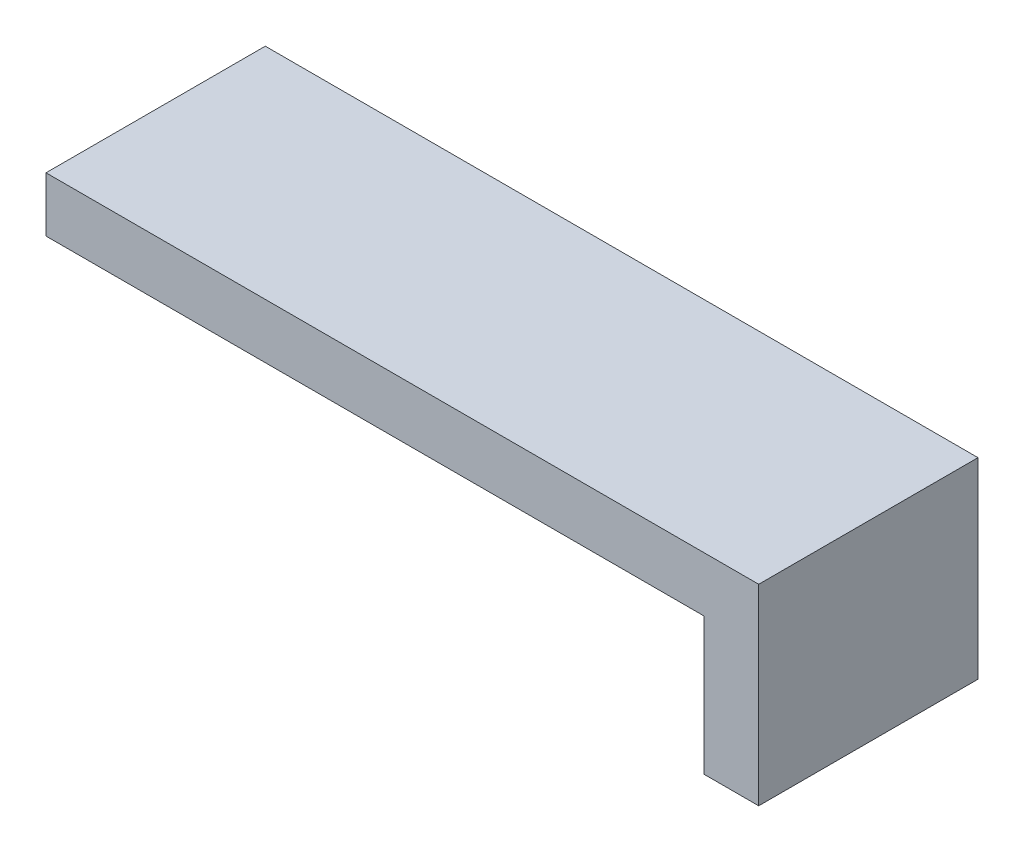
ISO-10303-21;
HEADER;
FILE_DESCRIPTION(('STEP AP214'),'2;1');
FILE_NAME('part.step','',(''),(''),'','','');
FILE_SCHEMA(('AUTOMOTIVE_DESIGN { 1 0 10303 214 1 1 1 1 }'));
ENDSEC;
DATA;
#1=APPLICATION_CONTEXT('core data for automotive mechanical design processes');
#2=APPLICATION_PROTOCOL_DEFINITION('international standard','automotive_design',2000,#1);
#3=PRODUCT_CONTEXT('',#1,'mechanical');
#4=PRODUCT('Part','Part','',(#3));
#5=PRODUCT_RELATED_PRODUCT_CATEGORY('part','',(#4));
#6=PRODUCT_DEFINITION_FORMATION('','',#4);
#7=PRODUCT_DEFINITION_CONTEXT('part definition',#1,'design');
#8=PRODUCT_DEFINITION('design','',#6,#7);
#9=PRODUCT_DEFINITION_SHAPE('','',#8);
#10=(LENGTH_UNIT() NAMED_UNIT(*) SI_UNIT(.MILLI.,.METRE.));
#11=(NAMED_UNIT(*) PLANE_ANGLE_UNIT() SI_UNIT($,.RADIAN.));
#12=(NAMED_UNIT(*) SI_UNIT($,.STERADIAN.) SOLID_ANGLE_UNIT());
#13=UNCERTAINTY_MEASURE_WITH_UNIT(LENGTH_MEASURE(1.E-05),#10,'distance_accuracy_value','');
#14=(GEOMETRIC_REPRESENTATION_CONTEXT(3) GLOBAL_UNCERTAINTY_ASSIGNED_CONTEXT((#13)) GLOBAL_UNIT_ASSIGNED_CONTEXT((#10,
#11,#12)) REPRESENTATION_CONTEXT('',''));
#15=CARTESIAN_POINT('',(0.,0.,0.));
#16=DIRECTION('',(0.,0.,1.));
#17=DIRECTION('',(1.,0.,0.));
#18=AXIS2_PLACEMENT_3D('',#15,#16,#17);
#19=CARTESIAN_POINT('',(-60.,4.99999999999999,20.));
#20=DIRECTION('',(1.,0.,0.));
#21=DIRECTION('',(0.,1.,0.));
#22=AXIS2_PLACEMENT_3D('',#19,#20,#21);
#23=PLANE('',#22);
#24=DIRECTION('',(0.,-1.,0.));
#25=VECTOR('',#24,1.);
#26=CARTESIAN_POINT('',(-60.,4.99999999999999,-20.));
#27=LINE('',#26,#25);
#28=CARTESIAN_POINT('',(-60.,4.99999999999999,-20.));
#29=VERTEX_POINT('',#28);
#30=CARTESIAN_POINT('',(-59.9999999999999,-5.,-20.));
#31=VERTEX_POINT('',#30);
#32=EDGE_CURVE('E119',#29,#31,#27,.T.);
#33=ORIENTED_EDGE('',*,*,#32,.T.);
#34=DIRECTION('',(0.,0.,-1.));
#35=VECTOR('',#34,1.);
#36=CARTESIAN_POINT('',(-59.9999999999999,-5.,20.));
#37=LINE('',#36,#35);
#38=CARTESIAN_POINT('',(-59.9999999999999,-5.,20.));
#39=VERTEX_POINT('',#38);
#40=EDGE_CURVE('E11',#39,#31,#37,.T.);
#41=ORIENTED_EDGE('',*,*,#40,.F.);
#42=DIRECTION('',(0.,-1.,0.));
#43=VECTOR('',#42,1.);
#44=CARTESIAN_POINT('',(-60.,4.99999999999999,20.));
#45=LINE('',#44,#43);
#46=CARTESIAN_POINT('',(-60.,4.99999999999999,20.));
#47=VERTEX_POINT('',#46);
#48=EDGE_CURVE('E130',#47,#39,#45,.T.);
#49=ORIENTED_EDGE('',*,*,#48,.F.);
#50=DIRECTION('',(0.,0.,-1.));
#51=VECTOR('',#50,1.);
#52=CARTESIAN_POINT('',(-60.,4.99999999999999,20.));
#53=LINE('',#52,#51);
#54=EDGE_CURVE('E115',#47,#29,#53,.T.);
#55=ORIENTED_EDGE('',*,*,#54,.T.);
#56=EDGE_LOOP('',(#33,#41,#49,#55));
#57=FACE_BOUND('',#56,.T.);
#58=ADVANCED_FACE('F34',(#57),#23,.F.);
#59=CARTESIAN_POINT('',(60.0000000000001,-4.99999999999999,20.));
#60=DIRECTION('',(0.,1.,0.));
#61=DIRECTION('',(-1.,0.,0.));
#62=AXIS2_PLACEMENT_3D('',#59,#60,#61);
#63=PLANE('',#62);
#64=DIRECTION('',(1.,0.,0.));
#65=VECTOR('',#64,1.);
#66=CARTESIAN_POINT('',(60.0000000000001,-4.99999999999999,-20.));
#67=LINE('',#66,#65);
#68=CARTESIAN_POINT('',(60.0000000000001,-4.99999999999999,-20.));
#69=VERTEX_POINT('',#68);
#70=EDGE_CURVE('E122',#31,#69,#67,.T.);
#71=ORIENTED_EDGE('',*,*,#70,.T.);
#72=DIRECTION('',(0.,0.,-1.));
#73=VECTOR('',#72,1.);
#74=CARTESIAN_POINT('',(60.0000000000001,-4.99999999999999,20.));
#75=LINE('',#74,#73);
#76=CARTESIAN_POINT('',(60.0000000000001,-4.99999999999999,20.));
#77=VERTEX_POINT('',#76);
#78=EDGE_CURVE('E42',#77,#69,#75,.T.);
#79=ORIENTED_EDGE('',*,*,#78,.F.);
#80=DIRECTION('',(1.,0.,0.));
#81=VECTOR('',#80,1.);
#82=CARTESIAN_POINT('',(60.0000000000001,-4.99999999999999,20.));
#83=LINE('',#82,#81);
#84=EDGE_CURVE('E85',#39,#77,#83,.T.);
#85=ORIENTED_EDGE('',*,*,#84,.F.);
#86=ORIENTED_EDGE('',*,*,#40,.T.);
#87=EDGE_LOOP('',(#71,#79,#85,#86));
#88=FACE_BOUND('',#87,.T.);
#89=ADVANCED_FACE('F144',(#88),#63,.F.);
#90=CARTESIAN_POINT('',(60.0000000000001,-4.99999999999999,20.));
#91=DIRECTION('',(1.,0.,0.));
#92=DIRECTION('',(0.,1.,0.));
#93=AXIS2_PLACEMENT_3D('',#90,#91,#92);
#94=PLANE('',#93);
#95=DIRECTION('',(0.,-1.,0.));
#96=VECTOR('',#95,1.);
#97=CARTESIAN_POINT('',(60.0000000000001,-4.99999999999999,-20.));
#98=LINE('',#97,#96);
#99=CARTESIAN_POINT('',(60.0000000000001,-30.,-20.));
#100=VERTEX_POINT('',#99);
#101=EDGE_CURVE('E124',#69,#100,#98,.T.);
#102=ORIENTED_EDGE('',*,*,#101,.T.);
#103=DIRECTION('',(0.,0.,-1.));
#104=VECTOR('',#103,1.);
#105=CARTESIAN_POINT('',(60.0000000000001,-30.,20.));
#106=LINE('',#105,#104);
#107=CARTESIAN_POINT('',(60.0000000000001,-30.,20.));
#108=VERTEX_POINT('',#107);
#109=EDGE_CURVE('E110',#108,#100,#106,.T.);
#110=ORIENTED_EDGE('',*,*,#109,.F.);
#111=DIRECTION('',(0.,-1.,0.));
#112=VECTOR('',#111,1.);
#113=CARTESIAN_POINT('',(60.0000000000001,-4.99999999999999,20.));
#114=LINE('',#113,#112);
#115=EDGE_CURVE('E99',#77,#108,#114,.T.);
#116=ORIENTED_EDGE('',*,*,#115,.F.);
#117=ORIENTED_EDGE('',*,*,#78,.T.);
#118=EDGE_LOOP('',(#102,#110,#116,#117));
#119=FACE_BOUND('',#118,.T.);
#120=ADVANCED_FACE('F136',(#119),#94,.F.);
#121=CARTESIAN_POINT('',(60.0000000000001,-30.,20.));
#122=DIRECTION('',(0.,1.,0.));
#123=DIRECTION('',(0.,0.,1.));
#124=AXIS2_PLACEMENT_3D('',#121,#122,#123);
#125=PLANE('',#124);
#126=DIRECTION('',(1.,0.,0.));
#127=VECTOR('',#126,1.);
#128=CARTESIAN_POINT('',(60.0000000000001,-30.,-20.));
#129=LINE('',#128,#127);
#130=CARTESIAN_POINT('',(70.0000000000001,-30.,-20.));
#131=VERTEX_POINT('',#130);
#132=EDGE_CURVE('E108',#100,#131,#129,.T.);
#133=ORIENTED_EDGE('',*,*,#132,.T.);
#134=DIRECTION('',(0.,0.,-1.));
#135=VECTOR('',#134,1.);
#136=CARTESIAN_POINT('',(70.0000000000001,-30.,20.));
#137=LINE('',#136,#135);
#138=CARTESIAN_POINT('',(70.0000000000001,-30.,20.));
#139=VERTEX_POINT('',#138);
#140=EDGE_CURVE('E105',#139,#131,#137,.T.);
#141=ORIENTED_EDGE('',*,*,#140,.F.);
#142=DIRECTION('',(1.,0.,0.));
#143=VECTOR('',#142,1.);
#144=CARTESIAN_POINT('',(60.0000000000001,-30.,20.));
#145=LINE('',#144,#143);
#146=EDGE_CURVE('E92',#108,#139,#145,.T.);
#147=ORIENTED_EDGE('',*,*,#146,.F.);
#148=ORIENTED_EDGE('',*,*,#109,.T.);
#149=EDGE_LOOP('',(#133,#141,#147,#148));
#150=FACE_BOUND('',#149,.T.);
#151=ADVANCED_FACE('F106',(#150),#125,.F.);
#152=CARTESIAN_POINT('',(70.,5.00000000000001,20.));
#153=DIRECTION('',(-1.,0.,0.));
#154=DIRECTION('',(0.,-1.,0.));
#155=AXIS2_PLACEMENT_3D('',#152,#153,#154);
#156=PLANE('',#155);
#157=DIRECTION('',(0.,1.,0.));
#158=VECTOR('',#157,1.);
#159=CARTESIAN_POINT('',(70.,5.00000000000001,-20.));
#160=LINE('',#159,#158);
#161=CARTESIAN_POINT('',(70.,5.00000000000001,-20.));
#162=VERTEX_POINT('',#161);
#163=EDGE_CURVE('E127',#131,#162,#160,.T.);
#164=ORIENTED_EDGE('',*,*,#163,.T.);
#165=DIRECTION('',(0.,0.,-1.));
#166=VECTOR('',#165,1.);
#167=CARTESIAN_POINT('',(70.,5.00000000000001,20.));
#168=LINE('',#167,#166);
#169=CARTESIAN_POINT('',(70.,5.00000000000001,20.));
#170=VERTEX_POINT('',#169);
#171=EDGE_CURVE('E111',#170,#162,#168,.T.);
#172=ORIENTED_EDGE('',*,*,#171,.F.);
#173=DIRECTION('',(0.,1.,0.));
#174=VECTOR('',#173,1.);
#175=CARTESIAN_POINT('',(70.,5.00000000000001,20.));
#176=LINE('',#175,#174);
#177=EDGE_CURVE('E96',#139,#170,#176,.T.);
#178=ORIENTED_EDGE('',*,*,#177,.F.);
#179=ORIENTED_EDGE('',*,*,#140,.T.);
#180=EDGE_LOOP('',(#164,#172,#178,#179));
#181=FACE_BOUND('',#180,.T.);
#182=ADVANCED_FACE('F113',(#181),#156,.F.);
#183=CARTESIAN_POINT('',(60.0000000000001,5.00000000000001,20.));
#184=DIRECTION('',(0.,-1.,0.));
#185=DIRECTION('',(1.,0.,0.));
#186=AXIS2_PLACEMENT_3D('',#183,#184,#185);
#187=PLANE('',#186);
#188=DIRECTION('',(-1.,0.,0.));
#189=VECTOR('',#188,1.);
#190=CARTESIAN_POINT('',(60.0000000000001,5.00000000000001,-20.));
#191=LINE('',#190,#189);
#192=EDGE_CURVE('E73',#162,#29,#191,.T.);
#193=ORIENTED_EDGE('',*,*,#192,.T.);
#194=ORIENTED_EDGE('',*,*,#54,.F.);
#195=DIRECTION('',(-1.,0.,0.));
#196=VECTOR('',#195,1.);
#197=CARTESIAN_POINT('',(60.0000000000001,5.00000000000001,20.));
#198=LINE('',#197,#196);
#199=EDGE_CURVE('E50',#170,#47,#198,.T.);
#200=ORIENTED_EDGE('',*,*,#199,.F.);
#201=ORIENTED_EDGE('',*,*,#171,.T.);
#202=EDGE_LOOP('',(#193,#194,#200,#201));
#203=FACE_BOUND('',#202,.T.);
#204=ADVANCED_FACE('F138',(#203),#187,.F.);
#205=CARTESIAN_POINT('',(0.,0.,20.));
#206=DIRECTION('',(0.,0.,-1.));
#207=DIRECTION('',(-1.,0.,0.));
#208=AXIS2_PLACEMENT_3D('',#205,#206,#207);
#209=PLANE('',#208);
#210=ORIENTED_EDGE('',*,*,#48,.T.);
#211=ORIENTED_EDGE('',*,*,#84,.T.);
#212=ORIENTED_EDGE('',*,*,#115,.T.);
#213=ORIENTED_EDGE('',*,*,#146,.T.);
#214=ORIENTED_EDGE('',*,*,#177,.T.);
#215=ORIENTED_EDGE('',*,*,#199,.T.);
#216=EDGE_LOOP('',(#210,#211,#212,#213,#214,#215));
#217=FACE_BOUND('',#216,.T.);
#218=ADVANCED_FACE('F94',(#217),#209,.F.);
#219=CARTESIAN_POINT('',(0.,0.,-20.));
#220=DIRECTION('',(0.,0.,-1.));
#221=DIRECTION('',(-1.,0.,0.));
#222=AXIS2_PLACEMENT_3D('',#219,#220,#221);
#223=PLANE('',#222);
#224=ORIENTED_EDGE('',*,*,#32,.F.);
#225=ORIENTED_EDGE('',*,*,#192,.F.);
#226=ORIENTED_EDGE('',*,*,#163,.F.);
#227=ORIENTED_EDGE('',*,*,#132,.F.);
#228=ORIENTED_EDGE('',*,*,#101,.F.);
#229=ORIENTED_EDGE('',*,*,#70,.F.);
#230=EDGE_LOOP('',(#224,#225,#226,#227,#228,#229));
#231=FACE_BOUND('',#230,.T.);
#232=ADVANCED_FACE('F137',(#231),#223,.T.);
#233=CLOSED_SHELL('',(#58,#89,#120,#151,#182,#204,#218,#232));
#234=MANIFOLD_SOLID_BREP('B2',#233);
#235=ADVANCED_BREP_SHAPE_REPRESENTATION('',(#18,#234),#14);
#236=SHAPE_DEFINITION_REPRESENTATION(#9,#235);
ENDSEC;
END-ISO-10303-21;
